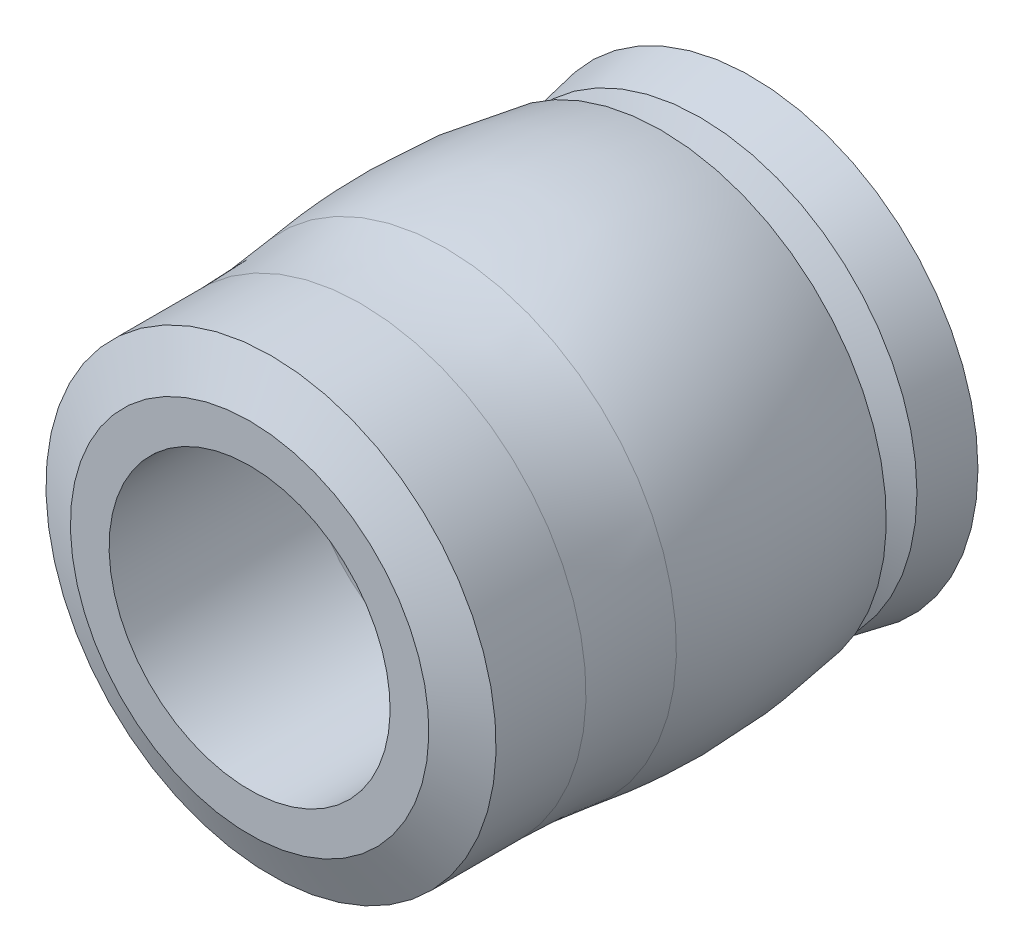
ISO-10303-21;
HEADER;
FILE_DESCRIPTION(('STEP AP214'),'2;1');
FILE_NAME('part.step','',(''),(''),'','','');
FILE_SCHEMA(('AUTOMOTIVE_DESIGN { 1 0 10303 214 1 1 1 1 }'));
ENDSEC;
DATA;
#1=APPLICATION_CONTEXT('core data for automotive mechanical design processes');
#2=APPLICATION_PROTOCOL_DEFINITION('international standard','automotive_design',2000,#1);
#3=PRODUCT_CONTEXT('',#1,'mechanical');
#4=PRODUCT('Part','Part','',(#3));
#5=PRODUCT_RELATED_PRODUCT_CATEGORY('part','',(#4));
#6=PRODUCT_DEFINITION_FORMATION('','',#4);
#7=PRODUCT_DEFINITION_CONTEXT('part definition',#1,'design');
#8=PRODUCT_DEFINITION('design','',#6,#7);
#9=PRODUCT_DEFINITION_SHAPE('','',#8);
#10=(LENGTH_UNIT() NAMED_UNIT(*) SI_UNIT(.MILLI.,.METRE.));
#11=(NAMED_UNIT(*) PLANE_ANGLE_UNIT() SI_UNIT($,.RADIAN.));
#12=(NAMED_UNIT(*) SI_UNIT($,.STERADIAN.) SOLID_ANGLE_UNIT());
#13=UNCERTAINTY_MEASURE_WITH_UNIT(LENGTH_MEASURE(1.E-05),#10,'distance_accuracy_value','');
#14=(GEOMETRIC_REPRESENTATION_CONTEXT(3) GLOBAL_UNCERTAINTY_ASSIGNED_CONTEXT((#13)) GLOBAL_UNIT_ASSIGNED_CONTEXT((#10,
#11,#12)) REPRESENTATION_CONTEXT('',''));
#15=CARTESIAN_POINT('',(0.,0.,0.));
#16=DIRECTION('',(0.,0.,1.));
#17=DIRECTION('',(1.,0.,0.));
#18=AXIS2_PLACEMENT_3D('',#15,#16,#17);
#19=CARTESIAN_POINT('',(0.,0.,9.63606939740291));
#20=DIRECTION('',(0.,0.,-1.));
#21=DIRECTION('',(0.,1.,0.));
#22=AXIS2_PLACEMENT_3D('',#19,#20,#21);
#23=TOROIDAL_SURFACE('',#22,13.2347478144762,0.470021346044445);
#24=CARTESIAN_POINT('',(0.,0.,9.63606939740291));
#25=DIRECTION('',(0.,0.,-1.));
#26=DIRECTION('',(0.,1.,0.));
#27=AXIS2_PLACEMENT_3D('',#24,#25,#26);
#28=CIRCLE('',#27,12.7647264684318);
#29=CARTESIAN_POINT('',(0.,12.7647264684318,9.63606939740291));
#30=VERTEX_POINT('',#29);
#31=EDGE_CURVE('E46',#30,#30,#28,.T.);
#32=ORIENTED_EDGE('',*,*,#31,.T.);
#33=EDGE_LOOP('',(#32));
#34=FACE_BOUND('',#33,.T.);
#35=CARTESIAN_POINT('',(0.,0.,9.80802842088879));
#36=DIRECTION('',(0.,0.,-1.));
#37=DIRECTION('',(0.,1.,0.));
#38=AXIS2_PLACEMENT_3D('',#35,#36,#37);
#39=CIRCLE('',#38,12.797311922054);
#40=CARTESIAN_POINT('',(-12.797311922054,0.,9.80802842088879));
#41=VERTEX_POINT('',#40);
#42=CARTESIAN_POINT('',(12.797311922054,0.,9.80802842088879));
#43=VERTEX_POINT('',#42);
#44=EDGE_CURVE('E43',#41,#43,#39,.T.);
#45=ORIENTED_EDGE('',*,*,#44,.F.);
#46=CARTESIAN_POINT('',(0.,0.,9.80802842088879));
#47=DIRECTION('',(0.,0.,-1.));
#48=DIRECTION('',(0.,1.,0.));
#49=AXIS2_PLACEMENT_3D('',#46,#47,#48);
#50=CIRCLE('',#49,12.797311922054);
#51=EDGE_CURVE('E41',#43,#41,#50,.T.);
#52=ORIENTED_EDGE('',*,*,#51,.F.);
#53=EDGE_LOOP('',(#45,#52));
#54=FACE_BOUND('',#53,.T.);
#55=ADVANCED_FACE('F14',(#34,#54),#23,.T.);
#56=CARTESIAN_POINT('',(0.,0.,-45.1453127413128));
#57=DIRECTION('',(0.,0.,-1.));
#58=DIRECTION('',(0.,1.,0.));
#59=AXIS2_PLACEMENT_3D('',#56,#57,#58);
#60=CYLINDRICAL_SURFACE('',#59,12.7647264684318);
#61=CARTESIAN_POINT('',(0.,0.,9.30586939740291));
#62=DIRECTION('',(0.,0.,1.));
#63=DIRECTION('',(0.,-1.,0.));
#64=AXIS2_PLACEMENT_3D('',#61,#62,#63);
#65=CIRCLE('',#64,12.7647264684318);
#66=CARTESIAN_POINT('',(0.,-12.7647264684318,9.30586939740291));
#67=VERTEX_POINT('',#66);
#68=EDGE_CURVE('E55',#67,#67,#65,.F.);
#69=ORIENTED_EDGE('',*,*,#68,.T.);
#70=EDGE_LOOP('',(#69));
#71=FACE_BOUND('',#70,.T.);
#72=ORIENTED_EDGE('',*,*,#31,.F.);
#73=EDGE_LOOP('',(#72));
#74=FACE_BOUND('',#73,.T.);
#75=ADVANCED_FACE('F163',(#71,#74),#60,.F.);
#76=CARTESIAN_POINT('',(-12.446,0.,27.1319510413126));
#77=CARTESIAN_POINT('',(-12.446,24.892,27.1319510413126));
#78=CARTESIAN_POINT('',(12.446,24.892,27.1319510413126));
#79=CARTESIAN_POINT('',(12.446,0.,27.1319510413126));
#80=CARTESIAN_POINT('',(-14.4774709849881,0.,18.606657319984));
#81=CARTESIAN_POINT('',(-14.4774709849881,28.9549419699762,18.6066573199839));
#82=CARTESIAN_POINT('',(14.4774709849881,28.9549419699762,18.6066573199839));
#83=CARTESIAN_POINT('',(14.4774709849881,0.,18.606657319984));
#84=CARTESIAN_POINT('',(-12.797311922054,0.,9.80802842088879));
#85=CARTESIAN_POINT('',(-12.797311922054,25.594623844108,9.80802842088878));
#86=CARTESIAN_POINT('',(12.797311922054,25.594623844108,9.80802842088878));
#87=CARTESIAN_POINT('',(12.797311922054,0.,9.80802842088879));
#88=(BOUNDED_SURFACE() B_SPLINE_SURFACE(2,3,((#76,#77,#78,#79),(#80,#81,#82,#83),(#84,#85,#86,
#87)),.UNSPECIFIED.,.F.,.F.,.F.) B_SPLINE_SURFACE_WITH_KNOTS((3,3),(4,4),(0.,1.),(0.,1.),
.UNSPECIFIED.) GEOMETRIC_REPRESENTATION_ITEM() RATIONAL_B_SPLINE_SURFACE(((1.,0.333333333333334,
0.333333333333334,1.),(1.,0.333333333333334,0.333333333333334,1.),(1.,0.333333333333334,
0.333333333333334,1.))) REPRESENTATION_ITEM('') SURFACE());
#89=CARTESIAN_POINT('',(12.446,0.,27.1319510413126));
#90=CARTESIAN_POINT('',(14.4774709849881,0.,18.606657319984));
#91=CARTESIAN_POINT('',(12.797311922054,0.,9.80802842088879));
#92=B_SPLINE_CURVE_WITH_KNOTS('',2,(#89,#90,#91),.UNSPECIFIED.,.F.,.F.,(3,3),(0.,1.),.UNSPECIFIED.);
#93=CARTESIAN_POINT('',(12.446,0.,27.1319510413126));
#94=VERTEX_POINT('',#93);
#95=EDGE_CURVE('E52',#94,#43,#92,.T.);
#96=CARTESIAN_POINT('',(0.,0.,27.1319510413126));
#97=DIRECTION('',(0.,0.,-1.));
#98=DIRECTION('',(0.,1.,0.));
#99=AXIS2_PLACEMENT_3D('',#96,#97,#98);
#100=CIRCLE('',#99,12.446);
#101=CARTESIAN_POINT('',(-12.446,0.,27.1319510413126));
#102=VERTEX_POINT('',#101);
#103=EDGE_CURVE('E33',#94,#102,#100,.F.);
#104=CARTESIAN_POINT('',(-12.446,0.,27.1319510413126));
#105=CARTESIAN_POINT('',(-14.4774709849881,0.,18.606657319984));
#106=CARTESIAN_POINT('',(-12.797311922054,0.,9.80802842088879));
#107=B_SPLINE_CURVE_WITH_KNOTS('',2,(#104,#105,#106),.UNSPECIFIED.,.F.,.F.,(3,3),(0.,1.),.UNSPECIFIED.);
#108=EDGE_CURVE('E45',#41,#102,#107,.F.);
#109=ORIENTED_EDGE('',*,*,#95,.F.);
#110=ORIENTED_EDGE('',*,*,#103,.T.);
#111=ORIENTED_EDGE('',*,*,#108,.F.);
#112=ORIENTED_EDGE('',*,*,#44,.T.);
#113=EDGE_LOOP('',(#109,#110,#111,#112));
#114=FACE_BOUND('',#113,.T.);
#115=ADVANCED_FACE('F48',(#114),#88,.T.);
#116=CARTESIAN_POINT('',(12.446,0.,27.1319510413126));
#117=CARTESIAN_POINT('',(12.446,-24.892,27.1319510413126));
#118=CARTESIAN_POINT('',(-12.446,-24.892,27.1319510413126));
#119=CARTESIAN_POINT('',(-12.446,0.,27.1319510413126));
#120=CARTESIAN_POINT('',(14.4774709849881,0.,18.606657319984));
#121=CARTESIAN_POINT('',(14.4774709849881,-28.9549419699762,18.6066573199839));
#122=CARTESIAN_POINT('',(-14.4774709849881,-28.9549419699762,18.6066573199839));
#123=CARTESIAN_POINT('',(-14.4774709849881,0.,18.606657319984));
#124=CARTESIAN_POINT('',(12.797311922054,0.,9.80802842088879));
#125=CARTESIAN_POINT('',(12.797311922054,-25.594623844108,9.80802842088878));
#126=CARTESIAN_POINT('',(-12.797311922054,-25.594623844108,9.80802842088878));
#127=CARTESIAN_POINT('',(-12.797311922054,0.,9.80802842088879));
#128=(BOUNDED_SURFACE() B_SPLINE_SURFACE(2,3,((#116,#117,#118,#119),(#120,#121,#122,#123),(#124,
#125,#126,#127)),.UNSPECIFIED.,.F.,.F.,.F.) B_SPLINE_SURFACE_WITH_KNOTS((3,3),(4,4),(0.,1.),(0.,
1.),.UNSPECIFIED.) GEOMETRIC_REPRESENTATION_ITEM() RATIONAL_B_SPLINE_SURFACE(((1.,
0.333333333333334,0.333333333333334,1.),(1.,0.333333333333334,0.333333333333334,1.),(1.,
0.333333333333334,0.333333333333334,1.))) REPRESENTATION_ITEM('') SURFACE());
#129=CARTESIAN_POINT('',(0.,0.,27.1319510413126));
#130=DIRECTION('',(0.,0.,-1.));
#131=DIRECTION('',(0.,1.,0.));
#132=AXIS2_PLACEMENT_3D('',#129,#130,#131);
#133=CIRCLE('',#132,12.446);
#134=EDGE_CURVE('E78',#102,#94,#133,.F.);
#135=ORIENTED_EDGE('',*,*,#95,.T.);
#136=ORIENTED_EDGE('',*,*,#51,.T.);
#137=ORIENTED_EDGE('',*,*,#108,.T.);
#138=ORIENTED_EDGE('',*,*,#134,.T.);
#139=EDGE_LOOP('',(#135,#136,#137,#138));
#140=FACE_BOUND('',#139,.T.);
#141=ADVANCED_FACE('F54',(#140),#128,.T.);
#142=CARTESIAN_POINT('',(0.,0.,9.30586939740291));
#143=DIRECTION('',(0.,0.,1.));
#144=DIRECTION('',(0.,-1.,0.));
#145=AXIS2_PLACEMENT_3D('',#142,#143,#144);
#146=CONICAL_SURFACE('',#145,12.7647264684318,0.925644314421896);
#147=ORIENTED_EDGE('',*,*,#68,.F.);
#148=EDGE_LOOP('',(#147));
#149=FACE_BOUND('',#148,.T.);
#150=CARTESIAN_POINT('',(0.,0.,4.86056902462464));
#151=DIRECTION('',(0.,0.,-1.));
#152=DIRECTION('',(0.,1.,0.));
#153=AXIS2_PLACEMENT_3D('',#150,#151,#152);
#154=CIRCLE('',#153,6.858);
#155=CARTESIAN_POINT('',(0.,6.858,4.86056902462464));
#156=VERTEX_POINT('',#155);
#157=EDGE_CURVE('E74',#156,#156,#154,.T.);
#158=ORIENTED_EDGE('',*,*,#157,.T.);
#159=EDGE_LOOP('',(#158));
#160=FACE_BOUND('',#159,.T.);
#161=ADVANCED_FACE('F146',(#149,#160),#146,.F.);
#162=CARTESIAN_POINT('',(0.,0.,-45.1453127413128));
#163=DIRECTION('',(0.,0.,-1.));
#164=DIRECTION('',(0.,1.,0.));
#165=AXIS2_PLACEMENT_3D('',#162,#163,#164);
#166=CYLINDRICAL_SURFACE('',#165,12.446);
#167=ORIENTED_EDGE('',*,*,#103,.F.);
#168=ORIENTED_EDGE('',*,*,#134,.F.);
#169=EDGE_LOOP('',(#167,#168));
#170=FACE_BOUND('',#169,.T.);
#171=CARTESIAN_POINT('',(0.,0.,44.45));
#172=DIRECTION('',(0.,0.,-1.));
#173=DIRECTION('',(0.,1.,0.));
#174=AXIS2_PLACEMENT_3D('',#171,#172,#173);
#175=CIRCLE('',#174,12.446);
#176=CARTESIAN_POINT('',(0.,12.446,44.45));
#177=VERTEX_POINT('',#176);
#178=EDGE_CURVE('E18',#177,#177,#175,.T.);
#179=ORIENTED_EDGE('',*,*,#178,.F.);
#180=EDGE_LOOP('',(#179));
#181=FACE_BOUND('',#180,.T.);
#182=ADVANCED_FACE('F142',(#170,#181),#166,.F.);
#183=CARTESIAN_POINT('',(0.,0.,-45.1453127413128));
#184=DIRECTION('',(0.,0.,-1.));
#185=DIRECTION('',(0.,1.,0.));
#186=AXIS2_PLACEMENT_3D('',#183,#184,#185);
#187=CYLINDRICAL_SURFACE('',#186,6.858);
#188=CARTESIAN_POINT('',(0.,0.,0.));
#189=DIRECTION('',(0.,0.,-1.));
#190=DIRECTION('',(0.,1.,0.));
#191=AXIS2_PLACEMENT_3D('',#188,#189,#190);
#192=CIRCLE('',#191,6.858);
#193=CARTESIAN_POINT('',(0.,6.858,0.));
#194=VERTEX_POINT('',#193);
#195=EDGE_CURVE('E69',#194,#194,#192,.F.);
#196=ORIENTED_EDGE('',*,*,#195,.F.);
#197=EDGE_LOOP('',(#196));
#198=FACE_BOUND('',#197,.T.);
#199=ORIENTED_EDGE('',*,*,#157,.F.);
#200=EDGE_LOOP('',(#199));
#201=FACE_BOUND('',#200,.T.);
#202=ADVANCED_FACE('F138',(#198,#201),#187,.F.);
#203=CARTESIAN_POINT('',(15.875,0.,44.45));
#204=DIRECTION('',(0.,0.,1.));
#205=DIRECTION('',(0.,-1.,0.));
#206=AXIS2_PLACEMENT_3D('',#203,#204,#205);
#207=PLANE('',#206);
#208=CARTESIAN_POINT('',(0.,0.,44.45));
#209=DIRECTION('',(0.,0.,-1.));
#210=DIRECTION('',(0.,1.,0.));
#211=AXIS2_PLACEMENT_3D('',#208,#209,#210);
#212=CIRCLE('',#211,15.875);
#213=CARTESIAN_POINT('',(0.,15.875,44.45));
#214=VERTEX_POINT('',#213);
#215=EDGE_CURVE('E67',#214,#214,#212,.T.);
#216=ORIENTED_EDGE('',*,*,#215,.F.);
#217=EDGE_LOOP('',(#216));
#218=FACE_BOUND('',#217,.T.);
#219=ORIENTED_EDGE('',*,*,#178,.T.);
#220=EDGE_LOOP('',(#219));
#221=FACE_BOUND('',#220,.T.);
#222=ADVANCED_FACE('F135',(#218,#221),#207,.T.);
#223=CARTESIAN_POINT('',(6.858,0.,0.));
#224=DIRECTION('',(0.,0.,-1.));
#225=DIRECTION('',(0.,1.,0.));
#226=AXIS2_PLACEMENT_3D('',#223,#224,#225);
#227=PLANE('',#226);
#228=ORIENTED_EDGE('',*,*,#195,.T.);
#229=EDGE_LOOP('',(#228));
#230=FACE_BOUND('',#229,.T.);
#231=CARTESIAN_POINT('',(0.,0.,0.));
#232=DIRECTION('',(0.,0.,-1.));
#233=DIRECTION('',(1.,0.,0.));
#234=AXIS2_PLACEMENT_3D('',#231,#232,#233);
#235=CIRCLE('',#234,20.066);
#236=CARTESIAN_POINT('',(20.066,0.,0.));
#237=VERTEX_POINT('',#236);
#238=EDGE_CURVE('E63',#237,#237,#235,.F.);
#239=ORIENTED_EDGE('',*,*,#238,.F.);
#240=EDGE_LOOP('',(#239));
#241=FACE_BOUND('',#240,.T.);
#242=ADVANCED_FACE('F131',(#230,#241),#227,.T.);
#243=CARTESIAN_POINT('',(0.,0.,42.5549256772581));
#244=DIRECTION('',(0.,0.,-1.));
#245=DIRECTION('',(0.,1.,0.));
#246=AXIS2_PLACEMENT_3D('',#243,#244,#245);
#247=CONICAL_SURFACE('',#246,19.939,1.13446401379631);
#248=ORIENTED_EDGE('',*,*,#215,.T.);
#249=EDGE_LOOP('',(#248));
#250=FACE_BOUND('',#249,.T.);
#251=CARTESIAN_POINT('',(0.,0.,42.5549256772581));
#252=DIRECTION('',(0.,0.,-1.));
#253=DIRECTION('',(0.,1.,0.));
#254=AXIS2_PLACEMENT_3D('',#251,#252,#253);
#255=CIRCLE('',#254,19.939);
#256=CARTESIAN_POINT('',(0.,19.939,42.5549256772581));
#257=VERTEX_POINT('',#256);
#258=EDGE_CURVE('E66',#257,#257,#255,.T.);
#259=ORIENTED_EDGE('',*,*,#258,.F.);
#260=EDGE_LOOP('',(#259));
#261=FACE_BOUND('',#260,.T.);
#262=ADVANCED_FACE('F127',(#250,#261),#247,.T.);
#263=CARTESIAN_POINT('',(0.,0.,0.));
#264=DIRECTION('',(0.,0.,-1.));
#265=DIRECTION('',(1.,0.,0.));
#266=AXIS2_PLACEMENT_3D('',#263,#264,#265);
#267=CONICAL_SURFACE('',#266,20.066,0.187512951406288);
#268=CARTESIAN_POINT('',(0.,0.,4.54372503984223));
#269=DIRECTION('',(0.,0.,-1.));
#270=DIRECTION('',(0.,1.,0.));
#271=AXIS2_PLACEMENT_3D('',#268,#269,#270);
#272=CIRCLE('',#271,19.2038643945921);
#273=CARTESIAN_POINT('',(0.,19.2038643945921,4.54372503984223));
#274=VERTEX_POINT('',#273);
#275=EDGE_CURVE('E98',#274,#274,#272,.F.);
#276=ORIENTED_EDGE('',*,*,#275,.F.);
#277=EDGE_LOOP('',(#276));
#278=FACE_BOUND('',#277,.T.);
#279=ORIENTED_EDGE('',*,*,#238,.T.);
#280=EDGE_LOOP('',(#279));
#281=FACE_BOUND('',#280,.T.);
#282=ADVANCED_FACE('F123',(#278,#281),#267,.T.);
#283=CARTESIAN_POINT('',(0.,0.,-45.1453127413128));
#284=DIRECTION('',(0.,0.,-1.));
#285=DIRECTION('',(0.,1.,0.));
#286=AXIS2_PLACEMENT_3D('',#283,#284,#285);
#287=CYLINDRICAL_SURFACE('',#286,19.939);
#288=ORIENTED_EDGE('',*,*,#258,.T.);
#289=EDGE_LOOP('',(#288));
#290=FACE_BOUND('',#289,.T.);
#291=CARTESIAN_POINT('',(0.,0.,34.5916498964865));
#292=DIRECTION('',(0.,0.,-1.));
#293=DIRECTION('',(0.,1.,0.));
#294=AXIS2_PLACEMENT_3D('',#291,#292,#293);
#295=CIRCLE('',#294,19.939);
#296=CARTESIAN_POINT('',(0.,19.939,34.5916498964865));
#297=VERTEX_POINT('',#296);
#298=EDGE_CURVE('E101',#297,#297,#295,.F.);
#299=ORIENTED_EDGE('',*,*,#298,.T.);
#300=EDGE_LOOP('',(#299));
#301=FACE_BOUND('',#300,.T.);
#302=ADVANCED_FACE('F119',(#290,#301),#287,.T.);
#303=CARTESIAN_POINT('',(0.,0.,4.54372503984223));
#304=DIRECTION('',(0.,0.,-1.));
#305=DIRECTION('',(0.,1.,0.));
#306=AXIS2_PLACEMENT_3D('',#303,#304,#305);
#307=CONICAL_SURFACE('',#306,19.2038643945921,1.13446401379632);
#308=CARTESIAN_POINT('',(0.,0.,6.096));
#309=DIRECTION('',(0.,0.,1.));
#310=DIRECTION('',(0.,-1.,0.));
#311=AXIS2_PLACEMENT_3D('',#308,#309,#310);
#312=CIRCLE('',#311,15.875);
#313=CARTESIAN_POINT('',(0.,-15.875,6.096));
#314=VERTEX_POINT('',#313);
#315=EDGE_CURVE('E104',#314,#314,#312,.T.);
#316=ORIENTED_EDGE('',*,*,#315,.F.);
#317=EDGE_LOOP('',(#316));
#318=FACE_BOUND('',#317,.T.);
#319=ORIENTED_EDGE('',*,*,#275,.T.);
#320=EDGE_LOOP('',(#319));
#321=FACE_BOUND('',#320,.T.);
#322=ADVANCED_FACE('F114',(#318,#321),#307,.T.);
#323=CARTESIAN_POINT('',(0.,0.,34.5916498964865));
#324=DIRECTION('',(0.,0.,-1.));
#325=DIRECTION('',(0.,1.,0.));
#326=AXIS2_PLACEMENT_3D('',#323,#324,#325);
#327=TOROIDAL_SURFACE('',#326,70.739,50.8);
#328=ORIENTED_EDGE('',*,*,#298,.F.);
#329=EDGE_LOOP('',(#328));
#330=FACE_BOUND('',#329,.T.);
#331=CARTESIAN_POINT('',(0.,0.,27.1319510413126));
#332=DIRECTION('',(0.,0.,-1.));
#333=DIRECTION('',(0.,1.,0.));
#334=AXIS2_PLACEMENT_3D('',#331,#332,#333);
#335=CIRCLE('',#334,20.4896926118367);
#336=CARTESIAN_POINT('',(0.,20.4896926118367,27.1319510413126));
#337=VERTEX_POINT('',#336);
#338=EDGE_CURVE('E24',#337,#337,#335,.T.);
#339=ORIENTED_EDGE('',*,*,#338,.F.);
#340=EDGE_LOOP('',(#339));
#341=FACE_BOUND('',#340,.T.);
#342=ADVANCED_FACE('F109',(#330,#341),#327,.F.);
#343=CARTESIAN_POINT('',(0.,0.,7.99107432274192));
#344=DIRECTION('',(0.,0.,1.));
#345=DIRECTION('',(0.,-1.,0.));
#346=AXIS2_PLACEMENT_3D('',#343,#344,#345);
#347=CONICAL_SURFACE('',#346,19.939,1.13446401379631);
#348=ORIENTED_EDGE('',*,*,#315,.T.);
#349=EDGE_LOOP('',(#348));
#350=FACE_BOUND('',#349,.T.);
#351=CARTESIAN_POINT('',(0.,0.,7.9910743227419));
#352=DIRECTION('',(0.,0.,-1.));
#353=DIRECTION('',(0.,1.,0.));
#354=AXIS2_PLACEMENT_3D('',#351,#352,#353);
#355=CIRCLE('',#354,19.939);
#356=CARTESIAN_POINT('',(0.,19.939,7.9910743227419));
#357=VERTEX_POINT('',#356);
#358=EDGE_CURVE('E9',#357,#357,#355,.F.);
#359=ORIENTED_EDGE('',*,*,#358,.F.);
#360=EDGE_LOOP('',(#359));
#361=FACE_BOUND('',#360,.T.);
#362=ADVANCED_FACE('F113',(#350,#361),#347,.T.);
#363=CARTESIAN_POINT('',(0.,-33.5568578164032,19.108537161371));
#364=DIRECTION('',(1.,0.,0.));
#365=DIRECTION('',(0.,1.,0.));
#366=AXIS2_PLACEMENT_3D('',#363,#364,#365);
#367=CIRCLE('',#366,54.6388578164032);
#368=TRIMMED_CURVE('',#367,(PARAMETER_VALUE(-0.90947851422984)),
(PARAMETER_VALUE(0.90947851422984)),.T.,.PARAMETER.);
#369=CARTESIAN_POINT('',(0.,0.,19.108537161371));
#370=DIRECTION('',(0.,0.,-1.));
#371=AXIS1_PLACEMENT('',#369,#370);
#372=SURFACE_OF_REVOLUTION('',#368,#371);
#373=ORIENTED_EDGE('',*,*,#338,.T.);
#374=EDGE_LOOP('',(#373));
#375=FACE_BOUND('',#374,.T.);
#376=ORIENTED_EDGE('',*,*,#358,.T.);
#377=EDGE_LOOP('',(#376));
#378=FACE_BOUND('',#377,.T.);
#379=ADVANCED_FACE('F178',(#375,#378),#372,.F.);
#380=CLOSED_SHELL('',(#55,#75,#115,#141,#161,#182,#202,#222,#242,#262,#282,#302,#322,#342,#362,#379));
#381=MANIFOLD_SOLID_BREP('B1',#380);
#382=ADVANCED_BREP_SHAPE_REPRESENTATION('',(#18,#381),#14);
#383=SHAPE_DEFINITION_REPRESENTATION(#9,#382);
ENDSEC;
END-ISO-10303-21;
